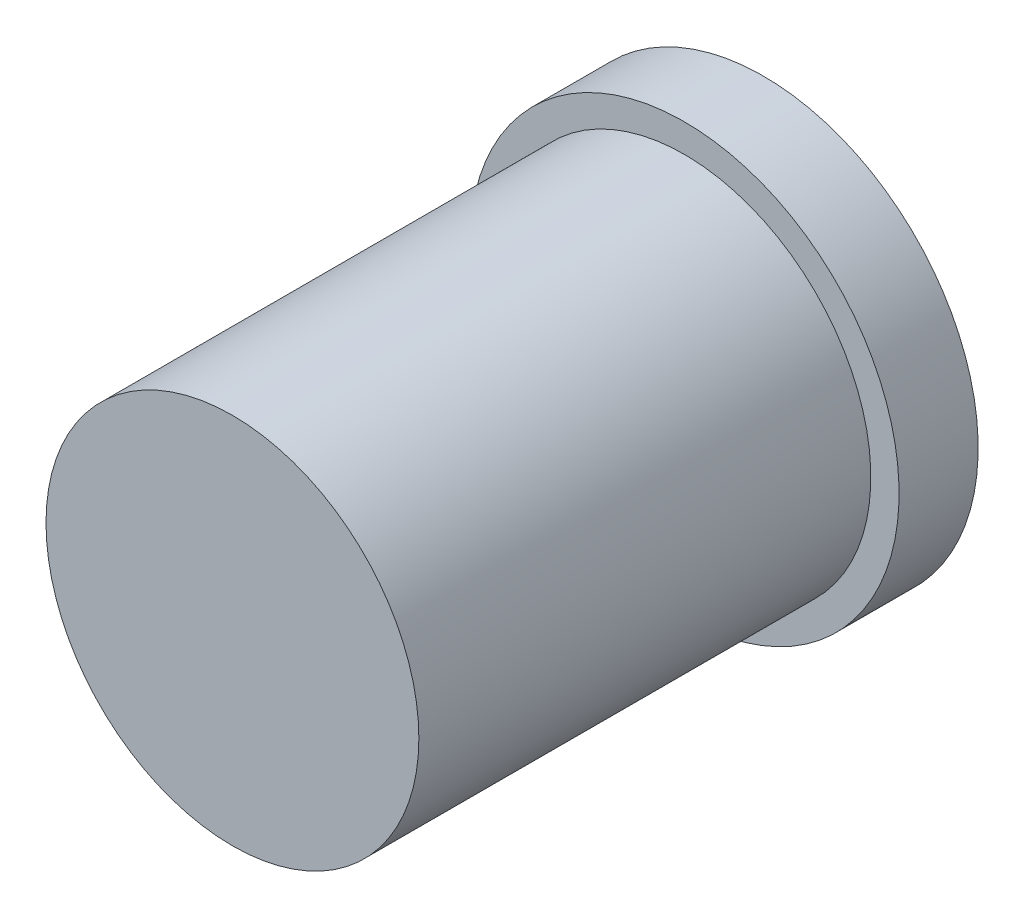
from build123d import *

# Parameters (mm, degrees)
ESQUISSE1_R      = 8.25
EXTRUSION1_DEPTH = 20
ESQUISSE2_R      = 9.5
EXTRUSION2_DEPTH = 3.5
EXTRUSION3_DEPTH = 1


with BuildPart() as part:
    # Esquisse1 → Extrusion1 (new body)
    with BuildSketch(Plane.XY):
        with Locations(Location((0, 0, 0), (0, 0, 180))):
            Circle(ESQUISSE1_R)
    extrude(amount=EXTRUSION1_DEPTH)

    # Esquisse2 → Extrusion2 (add)
    with BuildSketch(Plane(origin=(0, 0, 0), x_dir=(-1, 0, 0), z_dir=(0, 0, -1))):
        Circle(ESQUISSE2_R)
    extrude(amount=EXTRUSION2_DEPTH)

    # Esquisse3 → Extrusion3 (add)
    with BuildSketch(Plane(origin=(0, 0, -3.5), x_dir=(-1, 0, 0), z_dir=(0, 0, -1))):
        with BuildLine():
            Line((-5, -1.5), (-5, -3.5))
            ThreePointArc((-5, -3.5), (-4.853553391, -3.853553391), (-4.5, -4))
            Line((-4.5, -4), (4.5, -4))
            ThreePointArc((4.5, -4), (4.853553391, -3.853553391), (5, -3.5))
            Line((5, -3.5), (5, -1.5))
            ThreePointArc((5, -1.5), (5.292893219, -0.792893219), (6, -0.5))
            Line((6, -0.5), (6.837397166, -0.5))
            ThreePointArc((6.837397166, -0.5), (7.616590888, -0.873216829), (7.814168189, -1.714285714))
            ThreePointArc((7.814168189, -1.714285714), (0, -8), (-7.814168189, -1.714285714))
            ThreePointArc((-7.814168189, -1.714285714), (-7.616590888, -0.873216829), (-6.837397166, -0.5))
            Line((-6.837397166, -0.5), (-6, -0.5))
            ThreePointArc((-6, -0.5), (-5.292893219, -0.792893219), (-5, -1.5))
        make_face()
        with BuildLine():
            Line((-4.5, 4), (4.5, 4))
            ThreePointArc((4.5, 4), (4.853553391, 3.853553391), (5, 3.5))
            Line((5, 3.5), (5, 1.5))
            ThreePointArc((5, 1.5), (5.292893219, 0.792893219), (6, 0.5))
            Line((6, 0.5), (6.837397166, 0.5))
            ThreePointArc((6.837397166, 0.5), (7.616590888, 0.873216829), (7.814168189, 1.714285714))
            ThreePointArc((7.814168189, 1.714285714), (0, 8), (-7.814168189, 1.714285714))
            ThreePointArc((-7.814168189, 1.714285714), (-7.616590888, 0.873216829), (-6.837397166, 0.5))
            Line((-6.837397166, 0.5), (-6, 0.5))
            ThreePointArc((-6, 0.5), (-5.292893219, 0.792893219), (-5, 1.5))
            Line((-5, 1.5), (-5, 3.5))
            ThreePointArc((-5, 3.5), (-4.853553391, 3.853553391), (-4.5, 4))
        make_face()
    extrude(amount=EXTRUSION3_DEPTH)


solid = part.part
